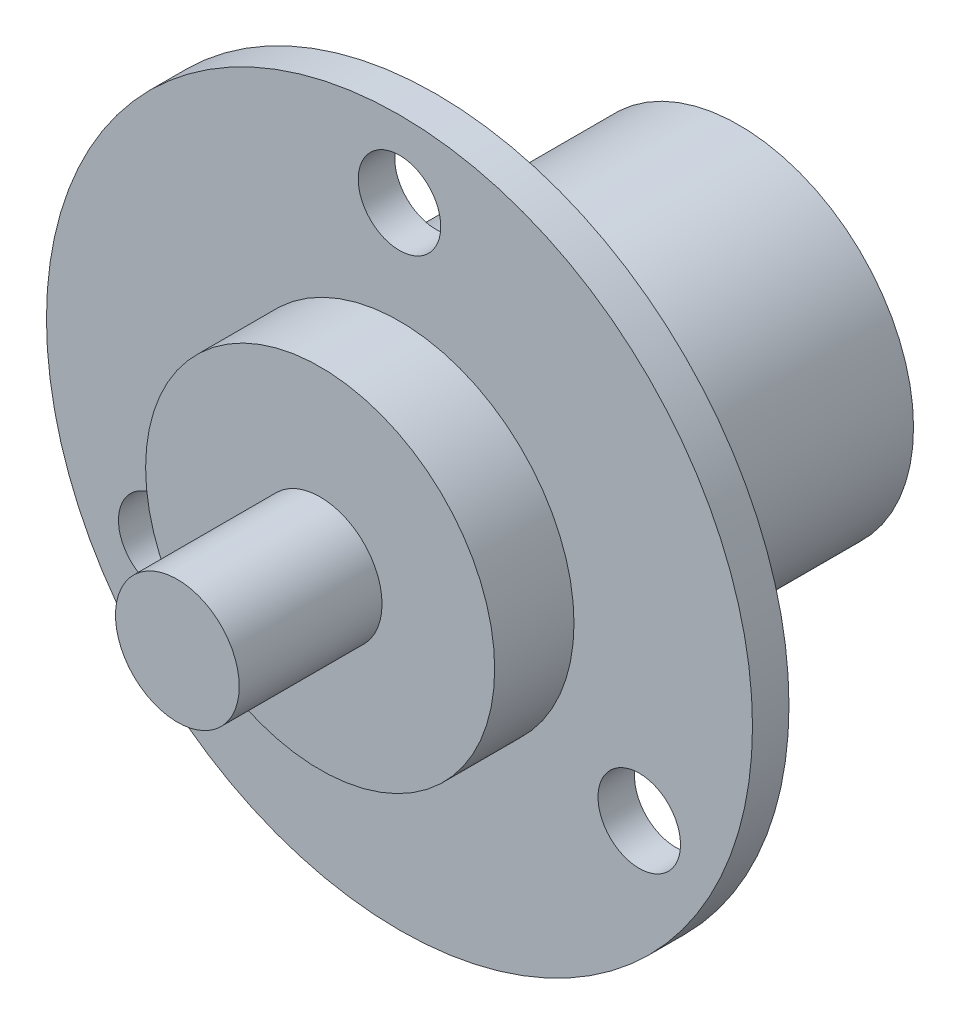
ISO-10303-21;
HEADER;
FILE_DESCRIPTION(('STEP AP214'),'2;1');
FILE_NAME('part.step','',(''),(''),'','','');
FILE_SCHEMA(('AUTOMOTIVE_DESIGN { 1 0 10303 214 1 1 1 1 }'));
ENDSEC;
DATA;
#1=APPLICATION_CONTEXT('core data for automotive mechanical design processes');
#2=APPLICATION_PROTOCOL_DEFINITION('international standard','automotive_design',2000,#1);
#3=PRODUCT_CONTEXT('',#1,'mechanical');
#4=PRODUCT('Part','Part','',(#3));
#5=PRODUCT_RELATED_PRODUCT_CATEGORY('part','',(#4));
#6=PRODUCT_DEFINITION_FORMATION('','',#4);
#7=PRODUCT_DEFINITION_CONTEXT('part definition',#1,'design');
#8=PRODUCT_DEFINITION('design','',#6,#7);
#9=PRODUCT_DEFINITION_SHAPE('','',#8);
#10=(LENGTH_UNIT() NAMED_UNIT(*) SI_UNIT(.MILLI.,.METRE.));
#11=(NAMED_UNIT(*) PLANE_ANGLE_UNIT() SI_UNIT($,.RADIAN.));
#12=(NAMED_UNIT(*) SI_UNIT($,.STERADIAN.) SOLID_ANGLE_UNIT());
#13=UNCERTAINTY_MEASURE_WITH_UNIT(LENGTH_MEASURE(1.E-05),#10,'distance_accuracy_value','');
#14=(GEOMETRIC_REPRESENTATION_CONTEXT(3) GLOBAL_UNCERTAINTY_ASSIGNED_CONTEXT((#13)) GLOBAL_UNIT_ASSIGNED_CONTEXT((#10,
#11,#12)) REPRESENTATION_CONTEXT('',''));
#15=CARTESIAN_POINT('',(0.,0.,0.));
#16=DIRECTION('',(0.,0.,1.));
#17=DIRECTION('',(1.,0.,0.));
#18=AXIS2_PLACEMENT_3D('',#15,#16,#17);
#19=CARTESIAN_POINT('',(0.,0.,26.4));
#20=DIRECTION('',(0.,0.,-1.));
#21=DIRECTION('',(-1.,0.,0.));
#22=AXIS2_PLACEMENT_3D('',#19,#20,#21);
#23=CYLINDRICAL_SURFACE('',#22,11.);
#24=CARTESIAN_POINT('',(0.,0.,0.));
#25=DIRECTION('',(0.,0.,1.));
#26=DIRECTION('',(1.,0.,0.));
#27=AXIS2_PLACEMENT_3D('',#24,#25,#26);
#28=CIRCLE('',#27,11.);
#29=CARTESIAN_POINT('',(11.,0.,0.));
#30=VERTEX_POINT('',#29);
#31=EDGE_CURVE('E82',#30,#30,#28,.T.);
#32=ORIENTED_EDGE('',*,*,#31,.T.);
#33=EDGE_LOOP('',(#32));
#34=FACE_BOUND('',#33,.T.);
#35=CARTESIAN_POINT('',(0.,0.,19.1));
#36=DIRECTION('',(0.,0.,1.));
#37=DIRECTION('',(1.,0.,0.));
#38=AXIS2_PLACEMENT_3D('',#35,#36,#37);
#39=CIRCLE('',#38,11.);
#40=CARTESIAN_POINT('',(11.,0.,19.1));
#41=VERTEX_POINT('',#40);
#42=EDGE_CURVE('E43',#41,#41,#39,.T.);
#43=ORIENTED_EDGE('',*,*,#42,.F.);
#44=EDGE_LOOP('',(#43));
#45=FACE_BOUND('',#44,.T.);
#46=ADVANCED_FACE('F39',(#34,#45),#23,.T.);
#47=CARTESIAN_POINT('',(0.,0.,0.));
#48=DIRECTION('',(0.,0.,1.));
#49=DIRECTION('',(1.,0.,0.));
#50=AXIS2_PLACEMENT_3D('',#47,#48,#49);
#51=PLANE('',#50);
#52=ORIENTED_EDGE('',*,*,#31,.F.);
#53=EDGE_LOOP('',(#52));
#54=FACE_BOUND('',#53,.T.);
#55=ADVANCED_FACE('F105',(#54),#51,.F.);
#56=CARTESIAN_POINT('',(0.,0.,19.1));
#57=DIRECTION('',(0.,0.,1.));
#58=DIRECTION('',(1.,0.,0.));
#59=AXIS2_PLACEMENT_3D('',#56,#57,#58);
#60=CYLINDRICAL_SURFACE('',#59,22.25);
#61=CARTESIAN_POINT('',(0.,0.,19.1));
#62=DIRECTION('',(0.,0.,1.));
#63=DIRECTION('',(1.,0.,0.));
#64=AXIS2_PLACEMENT_3D('',#61,#62,#63);
#65=CIRCLE('',#64,22.25);
#66=CARTESIAN_POINT('',(22.25,0.,19.1));
#67=VERTEX_POINT('',#66);
#68=EDGE_CURVE('E74',#67,#67,#65,.T.);
#69=ORIENTED_EDGE('',*,*,#68,.T.);
#70=EDGE_LOOP('',(#69));
#71=FACE_BOUND('',#70,.T.);
#72=CARTESIAN_POINT('',(0.,0.,21.4));
#73=DIRECTION('',(0.,0.,1.));
#74=DIRECTION('',(1.,0.,0.));
#75=AXIS2_PLACEMENT_3D('',#72,#73,#74);
#76=CIRCLE('',#75,22.25);
#77=CARTESIAN_POINT('',(22.25,0.,21.4));
#78=VERTEX_POINT('',#77);
#79=EDGE_CURVE('E71',#78,#78,#76,.T.);
#80=ORIENTED_EDGE('',*,*,#79,.F.);
#81=EDGE_LOOP('',(#80));
#82=FACE_BOUND('',#81,.T.);
#83=ADVANCED_FACE('F103',(#71,#82),#60,.T.);
#84=CARTESIAN_POINT('',(0.,0.,19.1));
#85=DIRECTION('',(0.,0.,1.));
#86=DIRECTION('',(1.,0.,0.));
#87=AXIS2_PLACEMENT_3D('',#84,#85,#86);
#88=PLANE('',#87);
#89=ORIENTED_EDGE('',*,*,#42,.T.);
#90=EDGE_LOOP('',(#89));
#91=FACE_BOUND('',#90,.T.);
#92=CARTESIAN_POINT('',(-15.1121432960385,-8.72499999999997,19.1));
#93=DIRECTION('',(0.,0.,1.));
#94=DIRECTION('',(1.,0.,0.));
#95=AXIS2_PLACEMENT_3D('',#92,#93,#94);
#96=CIRCLE('',#95,2.6);
#97=CARTESIAN_POINT('',(-12.5121432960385,-8.72499999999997,19.1));
#98=VERTEX_POINT('',#97);
#99=EDGE_CURVE('E55',#98,#98,#96,.T.);
#100=ORIENTED_EDGE('',*,*,#99,.T.);
#101=EDGE_LOOP('',(#100));
#102=FACE_BOUND('',#101,.T.);
#103=CARTESIAN_POINT('',(15.1121432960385,-8.72499999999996,19.1));
#104=DIRECTION('',(0.,0.,1.));
#105=DIRECTION('',(1.,0.,0.));
#106=AXIS2_PLACEMENT_3D('',#103,#104,#105);
#107=CIRCLE('',#106,2.6);
#108=CARTESIAN_POINT('',(17.7121432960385,-8.72499999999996,19.1));
#109=VERTEX_POINT('',#108);
#110=EDGE_CURVE('E62',#109,#109,#107,.T.);
#111=ORIENTED_EDGE('',*,*,#110,.T.);
#112=EDGE_LOOP('',(#111));
#113=FACE_BOUND('',#112,.T.);
#114=CARTESIAN_POINT('',(0.,17.45,19.1));
#115=DIRECTION('',(0.,0.,1.));
#116=DIRECTION('',(1.,0.,0.));
#117=AXIS2_PLACEMENT_3D('',#114,#115,#116);
#118=CIRCLE('',#117,2.6);
#119=CARTESIAN_POINT('',(2.6,17.45,19.1));
#120=VERTEX_POINT('',#119);
#121=EDGE_CURVE('E68',#120,#120,#118,.T.);
#122=ORIENTED_EDGE('',*,*,#121,.T.);
#123=EDGE_LOOP('',(#122));
#124=FACE_BOUND('',#123,.T.);
#125=ORIENTED_EDGE('',*,*,#68,.F.);
#126=EDGE_LOOP('',(#125));
#127=FACE_BOUND('',#126,.T.);
#128=ADVANCED_FACE('F93',(#91,#102,#113,#124,#127),#88,.F.);
#129=CARTESIAN_POINT('',(0.,0.,21.4));
#130=DIRECTION('',(0.,0.,1.));
#131=DIRECTION('',(1.,0.,0.));
#132=AXIS2_PLACEMENT_3D('',#129,#130,#131);
#133=PLANE('',#132);
#134=CARTESIAN_POINT('',(0.,0.,21.4));
#135=DIRECTION('',(0.,0.,1.));
#136=DIRECTION('',(1.,0.,0.));
#137=AXIS2_PLACEMENT_3D('',#134,#135,#136);
#138=CIRCLE('',#137,11.);
#139=CARTESIAN_POINT('',(11.,0.,21.4));
#140=VERTEX_POINT('',#139);
#141=EDGE_CURVE('E77',#140,#140,#138,.T.);
#142=ORIENTED_EDGE('',*,*,#141,.F.);
#143=EDGE_LOOP('',(#142));
#144=FACE_BOUND('',#143,.T.);
#145=CARTESIAN_POINT('',(-15.1121432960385,-8.72499999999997,21.4));
#146=DIRECTION('',(0.,0.,1.));
#147=DIRECTION('',(1.,0.,0.));
#148=AXIS2_PLACEMENT_3D('',#145,#146,#147);
#149=CIRCLE('',#148,2.6);
#150=CARTESIAN_POINT('',(-12.5121432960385,-8.72499999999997,21.4));
#151=VERTEX_POINT('',#150);
#152=EDGE_CURVE('E59',#151,#151,#149,.T.);
#153=ORIENTED_EDGE('',*,*,#152,.F.);
#154=EDGE_LOOP('',(#153));
#155=FACE_BOUND('',#154,.T.);
#156=CARTESIAN_POINT('',(15.1121432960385,-8.72499999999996,21.4));
#157=DIRECTION('',(0.,0.,1.));
#158=DIRECTION('',(1.,0.,0.));
#159=AXIS2_PLACEMENT_3D('',#156,#157,#158);
#160=CIRCLE('',#159,2.6);
#161=CARTESIAN_POINT('',(17.7121432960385,-8.72499999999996,21.4));
#162=VERTEX_POINT('',#161);
#163=EDGE_CURVE('E58',#162,#162,#160,.T.);
#164=ORIENTED_EDGE('',*,*,#163,.F.);
#165=EDGE_LOOP('',(#164));
#166=FACE_BOUND('',#165,.T.);
#167=CARTESIAN_POINT('',(0.,17.45,21.4));
#168=DIRECTION('',(0.,0.,1.));
#169=DIRECTION('',(1.,0.,0.));
#170=AXIS2_PLACEMENT_3D('',#167,#168,#169);
#171=CIRCLE('',#170,2.6);
#172=CARTESIAN_POINT('',(2.6,17.45,21.4));
#173=VERTEX_POINT('',#172);
#174=EDGE_CURVE('E65',#173,#173,#171,.T.);
#175=ORIENTED_EDGE('',*,*,#174,.F.);
#176=EDGE_LOOP('',(#175));
#177=FACE_BOUND('',#176,.T.);
#178=ORIENTED_EDGE('',*,*,#79,.T.);
#179=EDGE_LOOP('',(#178));
#180=FACE_BOUND('',#179,.T.);
#181=ADVANCED_FACE('F89',(#144,#155,#166,#177,#180),#133,.T.);
#182=CARTESIAN_POINT('',(0.,17.45,19.1));
#183=DIRECTION('',(0.,0.,1.));
#184=DIRECTION('',(1.,0.,0.));
#185=AXIS2_PLACEMENT_3D('',#182,#183,#184);
#186=CYLINDRICAL_SURFACE('',#185,2.6);
#187=ORIENTED_EDGE('',*,*,#121,.F.);
#188=EDGE_LOOP('',(#187));
#189=FACE_BOUND('',#188,.T.);
#190=ORIENTED_EDGE('',*,*,#174,.T.);
#191=EDGE_LOOP('',(#190));
#192=FACE_BOUND('',#191,.T.);
#193=ADVANCED_FACE('F92',(#189,#192),#186,.F.);
#194=CARTESIAN_POINT('',(15.1121432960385,-8.72499999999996,19.1));
#195=DIRECTION('',(0.,0.,1.));
#196=DIRECTION('',(1.,0.,0.));
#197=AXIS2_PLACEMENT_3D('',#194,#195,#196);
#198=CYLINDRICAL_SURFACE('',#197,2.6);
#199=ORIENTED_EDGE('',*,*,#110,.F.);
#200=EDGE_LOOP('',(#199));
#201=FACE_BOUND('',#200,.T.);
#202=ORIENTED_EDGE('',*,*,#163,.T.);
#203=EDGE_LOOP('',(#202));
#204=FACE_BOUND('',#203,.T.);
#205=ADVANCED_FACE('F136',(#201,#204),#198,.F.);
#206=CARTESIAN_POINT('',(-15.1121432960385,-8.72499999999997,19.1));
#207=DIRECTION('',(0.,0.,1.));
#208=DIRECTION('',(1.,0.,0.));
#209=AXIS2_PLACEMENT_3D('',#206,#207,#208);
#210=CYLINDRICAL_SURFACE('',#209,2.6);
#211=ORIENTED_EDGE('',*,*,#99,.F.);
#212=EDGE_LOOP('',(#211));
#213=FACE_BOUND('',#212,.T.);
#214=ORIENTED_EDGE('',*,*,#152,.T.);
#215=EDGE_LOOP('',(#214));
#216=FACE_BOUND('',#215,.T.);
#217=ADVANCED_FACE('F132',(#213,#216),#210,.F.);
#218=CARTESIAN_POINT('',(0.,0.,26.4));
#219=DIRECTION('',(0.,0.,1.));
#220=DIRECTION('',(1.,0.,0.));
#221=AXIS2_PLACEMENT_3D('',#218,#219,#220);
#222=PLANE('',#221);
#223=CARTESIAN_POINT('',(0.,0.,26.4));
#224=DIRECTION('',(0.,0.,1.));
#225=DIRECTION('',(1.,0.,0.));
#226=AXIS2_PLACEMENT_3D('',#223,#224,#225);
#227=CIRCLE('',#226,3.9);
#228=CARTESIAN_POINT('',(3.9,0.,26.4));
#229=VERTEX_POINT('',#228);
#230=EDGE_CURVE('E10',#229,#229,#227,.T.);
#231=ORIENTED_EDGE('',*,*,#230,.F.);
#232=EDGE_LOOP('',(#231));
#233=FACE_BOUND('',#232,.T.);
#234=CARTESIAN_POINT('',(0.,0.,26.4));
#235=DIRECTION('',(0.,0.,1.));
#236=DIRECTION('',(1.,0.,0.));
#237=AXIS2_PLACEMENT_3D('',#234,#235,#236);
#238=CIRCLE('',#237,11.);
#239=CARTESIAN_POINT('',(11.,0.,26.4));
#240=VERTEX_POINT('',#239);
#241=EDGE_CURVE('E51',#240,#240,#238,.T.);
#242=ORIENTED_EDGE('',*,*,#241,.T.);
#243=EDGE_LOOP('',(#242));
#244=FACE_BOUND('',#243,.T.);
#245=ADVANCED_FACE('F123',(#233,#244),#222,.T.);
#246=ORIENTED_EDGE('',*,*,#141,.T.);
#247=EDGE_LOOP('',(#246));
#248=FACE_BOUND('',#247,.T.);
#249=ORIENTED_EDGE('',*,*,#241,.F.);
#250=EDGE_LOOP('',(#249));
#251=FACE_BOUND('',#250,.T.);
#252=ADVANCED_FACE('F41',(#248,#251),#23,.T.);
#253=CARTESIAN_POINT('',(0.,0.,35.4));
#254=DIRECTION('',(0.,0.,-1.));
#255=DIRECTION('',(-1.,0.,0.));
#256=AXIS2_PLACEMENT_3D('',#253,#254,#255);
#257=CYLINDRICAL_SURFACE('',#256,3.9);
#258=CARTESIAN_POINT('',(0.,0.,35.4));
#259=DIRECTION('',(0.,0.,1.));
#260=DIRECTION('',(1.,0.,0.));
#261=AXIS2_PLACEMENT_3D('',#258,#259,#260);
#262=CIRCLE('',#261,3.9);
#263=CARTESIAN_POINT('',(3.9,0.,35.4));
#264=VERTEX_POINT('',#263);
#265=EDGE_CURVE('E54',#264,#264,#262,.T.);
#266=ORIENTED_EDGE('',*,*,#265,.F.);
#267=EDGE_LOOP('',(#266));
#268=FACE_BOUND('',#267,.T.);
#269=ORIENTED_EDGE('',*,*,#230,.T.);
#270=EDGE_LOOP('',(#269));
#271=FACE_BOUND('',#270,.T.);
#272=ADVANCED_FACE('F122',(#268,#271),#257,.T.);
#273=CARTESIAN_POINT('',(0.,0.,35.4));
#274=DIRECTION('',(0.,0.,1.));
#275=DIRECTION('',(1.,0.,0.));
#276=AXIS2_PLACEMENT_3D('',#273,#274,#275);
#277=PLANE('',#276);
#278=ORIENTED_EDGE('',*,*,#265,.T.);
#279=EDGE_LOOP('',(#278));
#280=FACE_BOUND('',#279,.T.);
#281=ADVANCED_FACE('F129',(#280),#277,.T.);
#282=CLOSED_SHELL('',(#46,#55,#83,#128,#181,#193,#205,#217,#245,#252,#272,#281));
#283=MANIFOLD_SOLID_BREP('B2',#282);
#284=ADVANCED_BREP_SHAPE_REPRESENTATION('',(#18,#283),#14);
#285=SHAPE_DEFINITION_REPRESENTATION(#9,#284);
ENDSEC;
END-ISO-10303-21;
